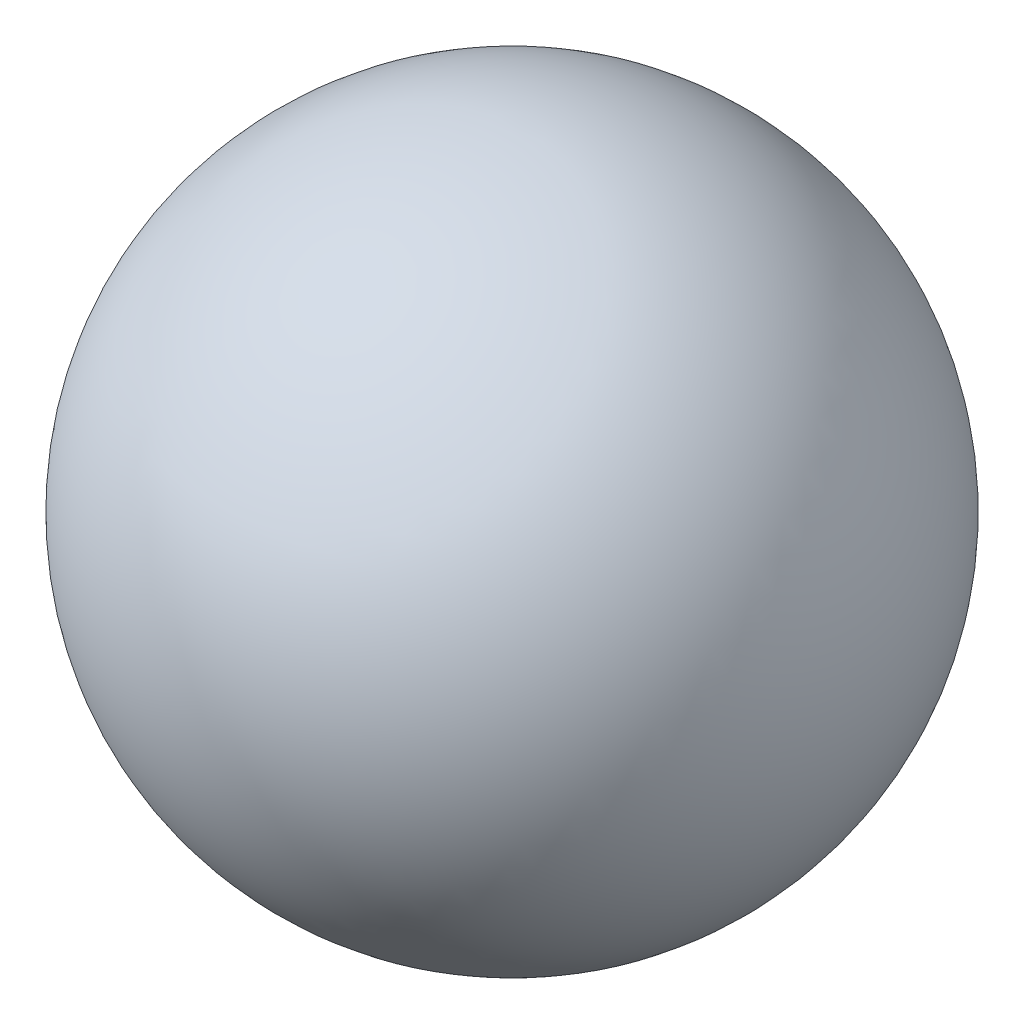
from build123d import *


with BuildPart() as part:
    # Sketch1 → Revolve1 (revolve)
    with BuildSketch(Plane.XY):
        with BuildLine():
            Line((0, 1.5875), (0, -1.5875))
            ThreePointArc((0, -1.5875), (1.5875, 0), (0, 1.5875))
        make_face()
    revolve(axis=Axis((0, 14.403892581, 0), (0, -1, 0)))


solid = part.part
